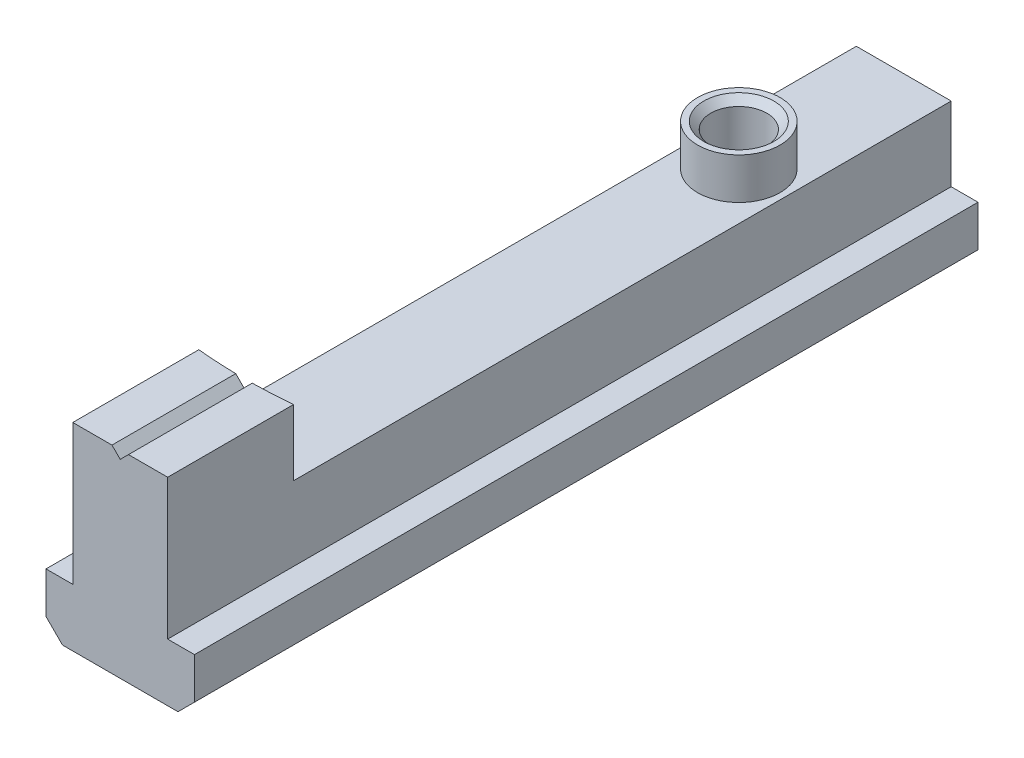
ISO-10303-21;
HEADER;
FILE_DESCRIPTION(('STEP AP214'),'2;1');
FILE_NAME('part.step','',(''),(''),'','','');
FILE_SCHEMA(('AUTOMOTIVE_DESIGN { 1 0 10303 214 1 1 1 1 }'));
ENDSEC;
DATA;
#1=APPLICATION_CONTEXT('core data for automotive mechanical design processes');
#2=APPLICATION_PROTOCOL_DEFINITION('international standard','automotive_design',2000,#1);
#3=PRODUCT_CONTEXT('',#1,'mechanical');
#4=PRODUCT('Part','Part','',(#3));
#5=PRODUCT_RELATED_PRODUCT_CATEGORY('part','',(#4));
#6=PRODUCT_DEFINITION_FORMATION('','',#4);
#7=PRODUCT_DEFINITION_CONTEXT('part definition',#1,'design');
#8=PRODUCT_DEFINITION('design','',#6,#7);
#9=PRODUCT_DEFINITION_SHAPE('','',#8);
#10=(LENGTH_UNIT() NAMED_UNIT(*) SI_UNIT(.MILLI.,.METRE.));
#11=(NAMED_UNIT(*) PLANE_ANGLE_UNIT() SI_UNIT($,.RADIAN.));
#12=(NAMED_UNIT(*) SI_UNIT($,.STERADIAN.) SOLID_ANGLE_UNIT());
#13=UNCERTAINTY_MEASURE_WITH_UNIT(LENGTH_MEASURE(1.E-05),#10,'distance_accuracy_value','');
#14=(GEOMETRIC_REPRESENTATION_CONTEXT(3) GLOBAL_UNCERTAINTY_ASSIGNED_CONTEXT((#13)) GLOBAL_UNIT_ASSIGNED_CONTEXT((#10,
#11,#12)) REPRESENTATION_CONTEXT('',''));
#15=CARTESIAN_POINT('',(0.,0.,0.));
#16=DIRECTION('',(0.,0.,1.));
#17=DIRECTION('',(1.,0.,0.));
#18=AXIS2_PLACEMENT_3D('',#15,#16,#17);
#19=CARTESIAN_POINT('',(8.99999999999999,16.,20.));
#20=DIRECTION('',(0.,1.,0.));
#21=DIRECTION('',(0.,0.,1.));
#22=AXIS2_PLACEMENT_3D('',#19,#20,#21);
#23=CYLINDRICAL_SURFACE('',#22,5.);
#24=CARTESIAN_POINT('',(8.99999999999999,16.,20.));
#25=DIRECTION('',(0.,1.,0.));
#26=DIRECTION('',(0.,0.,1.));
#27=AXIS2_PLACEMENT_3D('',#24,#25,#26);
#28=CIRCLE('',#27,5.);
#29=CARTESIAN_POINT('',(8.99999999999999,16.,25.));
#30=VERTEX_POINT('',#29);
#31=EDGE_CURVE('E257',#30,#30,#28,.T.);
#32=ORIENTED_EDGE('',*,*,#31,.T.);
#33=EDGE_LOOP('',(#32));
#34=FACE_BOUND('',#33,.T.);
#35=CARTESIAN_POINT('',(8.99999999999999,21.,20.));
#36=DIRECTION('',(0.,1.,0.));
#37=DIRECTION('',(0.,0.,1.));
#38=AXIS2_PLACEMENT_3D('',#35,#36,#37);
#39=CIRCLE('',#38,5.);
#40=CARTESIAN_POINT('',(8.99999999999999,21.,25.));
#41=VERTEX_POINT('',#40);
#42=EDGE_CURVE('E260',#41,#41,#39,.T.);
#43=ORIENTED_EDGE('',*,*,#42,.F.);
#44=EDGE_LOOP('',(#43));
#45=FACE_BOUND('',#44,.T.);
#46=ADVANCED_FACE('F30',(#34,#45),#23,.T.);
#47=CARTESIAN_POINT('',(14.75,24.,95.));
#48=DIRECTION('',(0.,-1.,0.));
#49=DIRECTION('',(0.,0.,-1.));
#50=AXIS2_PLACEMENT_3D('',#47,#48,#49);
#51=PLANE('',#50);
#52=DIRECTION('',(0.,0.,-1.));
#53=VECTOR('',#52,1.);
#54=CARTESIAN_POINT('',(14.75,24.,95.));
#55=LINE('',#54,#53);
#56=CARTESIAN_POINT('',(14.75,24.,95.));
#57=VERTEX_POINT('',#56);
#58=CARTESIAN_POINT('',(14.75,24.,79.7238436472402));
#59=VERTEX_POINT('',#58);
#60=EDGE_CURVE('E154',#57,#59,#55,.T.);
#61=ORIENTED_EDGE('',*,*,#60,.T.);
#62=CARTESIAN_POINT('',(8.99999999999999,24.,20.));
#63=DIRECTION('',(0.,1.,0.));
#64=DIRECTION('',(0.,0.,1.));
#65=AXIS2_PLACEMENT_3D('',#62,#63,#64);
#66=CIRCLE('',#65,60.);
#67=CARTESIAN_POINT('',(10.,24.,79.9916660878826));
#68=VERTEX_POINT('',#67);
#69=EDGE_CURVE('E139',#68,#59,#66,.T.);
#70=ORIENTED_EDGE('',*,*,#69,.F.);
#71=DIRECTION('',(0.,0.,1.));
#72=VECTOR('',#71,1.);
#73=CARTESIAN_POINT('',(10.,24.,75.));
#74=LINE('',#73,#72);
#75=CARTESIAN_POINT('',(10.,24.,95.));
#76=VERTEX_POINT('',#75);
#77=EDGE_CURVE('E151',#68,#76,#74,.T.);
#78=ORIENTED_EDGE('',*,*,#77,.T.);
#79=DIRECTION('',(-1.,0.,0.));
#80=VECTOR('',#79,1.);
#81=CARTESIAN_POINT('',(14.75,24.,95.));
#82=LINE('',#81,#80);
#83=EDGE_CURVE('E181',#57,#76,#82,.T.);
#84=ORIENTED_EDGE('',*,*,#83,.F.);
#85=EDGE_LOOP('',(#61,#70,#78,#84));
#86=FACE_BOUND('',#85,.T.);
#87=ADVANCED_FACE('F149',(#86),#51,.F.);
#88=CARTESIAN_POINT('',(0.,0.,0.));
#89=DIRECTION('',(0.,0.,1.));
#90=DIRECTION('',(1.,0.,0.));
#91=AXIS2_PLACEMENT_3D('',#88,#89,#90);
#92=PLANE('',#91);
#93=DIRECTION('',(-1.,0.,0.));
#94=VECTOR('',#93,1.);
#95=CARTESIAN_POINT('',(0.,16.,0.));
#96=LINE('',#95,#94);
#97=CARTESIAN_POINT('',(14.75,16.,0.));
#98=VERTEX_POINT('',#97);
#99=CARTESIAN_POINT('',(3.25,16.,0.));
#100=VERTEX_POINT('',#99);
#101=EDGE_CURVE('E11',#98,#100,#96,.T.);
#102=ORIENTED_EDGE('',*,*,#101,.F.);
#103=DIRECTION('',(0.,1.,0.));
#104=VECTOR('',#103,1.);
#105=CARTESIAN_POINT('',(14.75,7.,0.));
#106=LINE('',#105,#104);
#107=CARTESIAN_POINT('',(14.75,7.,0.));
#108=VERTEX_POINT('',#107);
#109=EDGE_CURVE('E198',#108,#98,#106,.T.);
#110=ORIENTED_EDGE('',*,*,#109,.F.);
#111=DIRECTION('',(-1.,0.,0.));
#112=VECTOR('',#111,1.);
#113=CARTESIAN_POINT('',(18.,7.,0.));
#114=LINE('',#113,#112);
#115=CARTESIAN_POINT('',(18.,7.,0.));
#116=VERTEX_POINT('',#115);
#117=EDGE_CURVE('E196',#116,#108,#114,.T.);
#118=ORIENTED_EDGE('',*,*,#117,.F.);
#119=DIRECTION('',(0.,1.,0.));
#120=VECTOR('',#119,1.);
#121=CARTESIAN_POINT('',(18.,0.,0.));
#122=LINE('',#121,#120);
#123=CARTESIAN_POINT('',(18.,2.00000000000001,0.));
#124=VERTEX_POINT('',#123);
#125=EDGE_CURVE('E194',#124,#116,#122,.T.);
#126=ORIENTED_EDGE('',*,*,#125,.F.);
#127=DIRECTION('',(0.707106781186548,0.707106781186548,0.));
#128=VECTOR('',#127,1.);
#129=CARTESIAN_POINT('',(18.,2.00000000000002,0.));
#130=LINE('',#129,#128);
#131=CARTESIAN_POINT('',(16.,0.,0.));
#132=VERTEX_POINT('',#131);
#133=EDGE_CURVE('E224',#124,#132,#130,.F.);
#134=ORIENTED_EDGE('',*,*,#133,.T.);
#135=DIRECTION('',(1.,0.,0.));
#136=VECTOR('',#135,1.);
#137=CARTESIAN_POINT('',(0.,0.,0.));
#138=LINE('',#137,#136);
#139=CARTESIAN_POINT('',(2.00000000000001,0.,0.));
#140=VERTEX_POINT('',#139);
#141=EDGE_CURVE('E191',#140,#132,#138,.T.);
#142=ORIENTED_EDGE('',*,*,#141,.F.);
#143=DIRECTION('',(0.707106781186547,-0.707106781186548,0.));
#144=VECTOR('',#143,1.);
#145=CARTESIAN_POINT('',(2.00000000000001,0.,0.));
#146=LINE('',#145,#144);
#147=CARTESIAN_POINT('',(0.,2.00000000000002,0.));
#148=VERTEX_POINT('',#147);
#149=EDGE_CURVE('E226',#140,#148,#146,.F.);
#150=ORIENTED_EDGE('',*,*,#149,.T.);
#151=DIRECTION('',(0.,-1.,0.));
#152=VECTOR('',#151,1.);
#153=CARTESIAN_POINT('',(0.,7.,0.));
#154=LINE('',#153,#152);
#155=CARTESIAN_POINT('',(0.,7.,0.));
#156=VERTEX_POINT('',#155);
#157=EDGE_CURVE('E188',#156,#148,#154,.T.);
#158=ORIENTED_EDGE('',*,*,#157,.F.);
#159=DIRECTION('',(-1.,0.,0.));
#160=VECTOR('',#159,1.);
#161=CARTESIAN_POINT('',(3.25,7.,0.));
#162=LINE('',#161,#160);
#163=CARTESIAN_POINT('',(3.25,7.,0.));
#164=VERTEX_POINT('',#163);
#165=EDGE_CURVE('E171',#164,#156,#162,.T.);
#166=ORIENTED_EDGE('',*,*,#165,.F.);
#167=DIRECTION('',(0.,-1.,0.));
#168=VECTOR('',#167,1.);
#169=CARTESIAN_POINT('',(3.25,24.,0.));
#170=LINE('',#169,#168);
#171=EDGE_CURVE('E201',#100,#164,#170,.T.);
#172=ORIENTED_EDGE('',*,*,#171,.F.);
#173=EDGE_LOOP('',(#102,#110,#118,#126,#134,#142,#150,#158,#166,#172));
#174=FACE_BOUND('',#173,.T.);
#175=ADVANCED_FACE('F309',(#174),#92,.F.);
#176=CARTESIAN_POINT('',(0.,7.,95.));
#177=DIRECTION('',(1.,0.,0.));
#178=DIRECTION('',(0.,1.,0.));
#179=AXIS2_PLACEMENT_3D('',#176,#177,#178);
#180=PLANE('',#179);
#181=ORIENTED_EDGE('',*,*,#157,.T.);
#182=DIRECTION('',(0.,0.,1.));
#183=VECTOR('',#182,1.);
#184=CARTESIAN_POINT('',(0.,2.00000000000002,95.));
#185=LINE('',#184,#183);
#186=CARTESIAN_POINT('',(0.,2.00000000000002,95.));
#187=VERTEX_POINT('',#186);
#188=EDGE_CURVE('E228',#148,#187,#185,.T.);
#189=ORIENTED_EDGE('',*,*,#188,.T.);
#190=DIRECTION('',(0.,-1.,0.));
#191=VECTOR('',#190,1.);
#192=CARTESIAN_POINT('',(0.,7.,95.));
#193=LINE('',#192,#191);
#194=CARTESIAN_POINT('',(0.,7.,95.));
#195=VERTEX_POINT('',#194);
#196=EDGE_CURVE('E167',#195,#187,#193,.T.);
#197=ORIENTED_EDGE('',*,*,#196,.F.);
#198=DIRECTION('',(0.,0.,-1.));
#199=VECTOR('',#198,1.);
#200=CARTESIAN_POINT('',(0.,7.,95.));
#201=LINE('',#200,#199);
#202=EDGE_CURVE('E187',#195,#156,#201,.T.);
#203=ORIENTED_EDGE('',*,*,#202,.T.);
#204=EDGE_LOOP('',(#181,#189,#197,#203));
#205=FACE_BOUND('',#204,.T.);
#206=ADVANCED_FACE('F328',(#205),#180,.F.);
#207=CARTESIAN_POINT('',(0.,0.,95.));
#208=DIRECTION('',(0.,1.,0.));
#209=DIRECTION('',(0.,0.,1.));
#210=AXIS2_PLACEMENT_3D('',#207,#208,#209);
#211=PLANE('',#210);
#212=CARTESIAN_POINT('',(8.99999999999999,0.,20.));
#213=DIRECTION('',(0.,1.,0.));
#214=DIRECTION('',(0.,0.,1.));
#215=AXIS2_PLACEMENT_3D('',#212,#213,#214);
#216=CIRCLE('',#215,4.24999999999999);
#217=CARTESIAN_POINT('',(8.99999999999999,0.,24.25));
#218=VERTEX_POINT('',#217);
#219=EDGE_CURVE('E272',#218,#218,#216,.T.);
#220=ORIENTED_EDGE('',*,*,#219,.T.);
#221=EDGE_LOOP('',(#220));
#222=FACE_BOUND('',#221,.T.);
#223=DIRECTION('',(1.,0.,0.));
#224=VECTOR('',#223,1.);
#225=CARTESIAN_POINT('',(0.,0.,95.));
#226=LINE('',#225,#224);
#227=CARTESIAN_POINT('',(2.00000000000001,0.,95.));
#228=VERTEX_POINT('',#227);
#229=CARTESIAN_POINT('',(16.,0.,95.));
#230=VERTEX_POINT('',#229);
#231=EDGE_CURVE('E170',#228,#230,#226,.T.);
#232=ORIENTED_EDGE('',*,*,#231,.F.);
#233=DIRECTION('',(0.,0.,-1.));
#234=VECTOR('',#233,1.);
#235=CARTESIAN_POINT('',(2.00000000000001,0.,95.));
#236=LINE('',#235,#234);
#237=EDGE_CURVE('E221',#228,#140,#236,.T.);
#238=ORIENTED_EDGE('',*,*,#237,.T.);
#239=ORIENTED_EDGE('',*,*,#141,.T.);
#240=DIRECTION('',(0.,0.,1.));
#241=VECTOR('',#240,1.);
#242=CARTESIAN_POINT('',(16.,0.,95.));
#243=LINE('',#242,#241);
#244=EDGE_CURVE('E219',#132,#230,#243,.T.);
#245=ORIENTED_EDGE('',*,*,#244,.T.);
#246=EDGE_LOOP('',(#232,#238,#239,#245));
#247=FACE_BOUND('',#246,.T.);
#248=ADVANCED_FACE('F276',(#222,#247),#211,.F.);
#249=CARTESIAN_POINT('',(18.,0.,95.));
#250=DIRECTION('',(-1.,0.,0.));
#251=DIRECTION('',(0.,0.,1.));
#252=AXIS2_PLACEMENT_3D('',#249,#250,#251);
#253=PLANE('',#252);
#254=DIRECTION('',(0.,1.,0.));
#255=VECTOR('',#254,1.);
#256=CARTESIAN_POINT('',(18.,0.,95.));
#257=LINE('',#256,#255);
#258=CARTESIAN_POINT('',(18.,2.00000000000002,95.));
#259=VERTEX_POINT('',#258);
#260=CARTESIAN_POINT('',(18.,7.,95.));
#261=VERTEX_POINT('',#260);
#262=EDGE_CURVE('E174',#259,#261,#257,.T.);
#263=ORIENTED_EDGE('',*,*,#262,.F.);
#264=DIRECTION('',(0.,0.,-1.));
#265=VECTOR('',#264,1.);
#266=CARTESIAN_POINT('',(18.,2.00000000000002,95.));
#267=LINE('',#266,#265);
#268=EDGE_CURVE('E234',#259,#124,#267,.T.);
#269=ORIENTED_EDGE('',*,*,#268,.T.);
#270=ORIENTED_EDGE('',*,*,#125,.T.);
#271=DIRECTION('',(0.,0.,-1.));
#272=VECTOR('',#271,1.);
#273=CARTESIAN_POINT('',(18.,7.,95.));
#274=LINE('',#273,#272);
#275=EDGE_CURVE('E216',#261,#116,#274,.T.);
#276=ORIENTED_EDGE('',*,*,#275,.F.);
#277=EDGE_LOOP('',(#263,#269,#270,#276));
#278=FACE_BOUND('',#277,.T.);
#279=ADVANCED_FACE('F345',(#278),#253,.F.);
#280=CARTESIAN_POINT('',(18.,7.,95.));
#281=DIRECTION('',(0.,-1.,0.));
#282=DIRECTION('',(0.,0.,-1.));
#283=AXIS2_PLACEMENT_3D('',#280,#281,#282);
#284=PLANE('',#283);
#285=ORIENTED_EDGE('',*,*,#117,.T.);
#286=DIRECTION('',(0.,0.,-1.));
#287=VECTOR('',#286,1.);
#288=CARTESIAN_POINT('',(14.75,7.,95.));
#289=LINE('',#288,#287);
#290=CARTESIAN_POINT('',(14.75,7.,95.));
#291=VERTEX_POINT('',#290);
#292=EDGE_CURVE('E213',#291,#108,#289,.T.);
#293=ORIENTED_EDGE('',*,*,#292,.F.);
#294=DIRECTION('',(-1.,0.,0.));
#295=VECTOR('',#294,1.);
#296=CARTESIAN_POINT('',(18.,7.,95.));
#297=LINE('',#296,#295);
#298=EDGE_CURVE('E176',#261,#291,#297,.T.);
#299=ORIENTED_EDGE('',*,*,#298,.F.);
#300=ORIENTED_EDGE('',*,*,#275,.T.);
#301=EDGE_LOOP('',(#285,#293,#299,#300));
#302=FACE_BOUND('',#301,.T.);
#303=ADVANCED_FACE('F341',(#302),#284,.F.);
#304=CARTESIAN_POINT('',(14.75,7.,95.));
#305=DIRECTION('',(-1.,0.,0.));
#306=DIRECTION('',(0.,0.,1.));
#307=AXIS2_PLACEMENT_3D('',#304,#305,#306);
#308=PLANE('',#307);
#309=DIRECTION('',(0.,0.,-1.));
#310=VECTOR('',#309,1.);
#311=CARTESIAN_POINT('',(14.75,16.,95.));
#312=LINE('',#311,#310);
#313=CARTESIAN_POINT('',(14.75,16.,79.7238436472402));
#314=VERTEX_POINT('',#313);
#315=EDGE_CURVE('E245',#314,#98,#312,.T.);
#316=ORIENTED_EDGE('',*,*,#315,.F.);
#317=DIRECTION('',(0.,1.,0.));
#318=VECTOR('',#317,1.);
#319=CARTESIAN_POINT('',(14.75,16.,79.7238436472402));
#320=LINE('',#319,#318);
#321=EDGE_CURVE('E251',#314,#59,#320,.T.);
#322=ORIENTED_EDGE('',*,*,#321,.T.);
#323=ORIENTED_EDGE('',*,*,#60,.F.);
#324=DIRECTION('',(0.,1.,0.));
#325=VECTOR('',#324,1.);
#326=CARTESIAN_POINT('',(14.75,7.,95.));
#327=LINE('',#326,#325);
#328=EDGE_CURVE('E178',#291,#57,#327,.T.);
#329=ORIENTED_EDGE('',*,*,#328,.F.);
#330=ORIENTED_EDGE('',*,*,#292,.T.);
#331=ORIENTED_EDGE('',*,*,#109,.T.);
#332=EDGE_LOOP('',(#316,#322,#323,#329,#330,#331));
#333=FACE_BOUND('',#332,.T.);
#334=ADVANCED_FACE('F338',(#333),#308,.F.);
#335=DIRECTION('',(0.,0.,1.));
#336=VECTOR('',#335,1.);
#337=CARTESIAN_POINT('',(8.,24.,75.));
#338=LINE('',#337,#336);
#339=CARTESIAN_POINT('',(8.,24.,79.9916660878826));
#340=VERTEX_POINT('',#339);
#341=CARTESIAN_POINT('',(8.,24.,95.));
#342=VERTEX_POINT('',#341);
#343=EDGE_CURVE('E52',#340,#342,#338,.T.);
#344=ORIENTED_EDGE('',*,*,#343,.F.);
#345=CARTESIAN_POINT('',(3.25,24.,79.7238436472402));
#346=VERTEX_POINT('',#345);
#347=EDGE_CURVE('E45',#346,#340,#66,.T.);
#348=ORIENTED_EDGE('',*,*,#347,.F.);
#349=DIRECTION('',(0.,0.,-1.));
#350=VECTOR('',#349,1.);
#351=CARTESIAN_POINT('',(3.25,24.,95.));
#352=LINE('',#351,#350);
#353=CARTESIAN_POINT('',(3.25,24.,95.));
#354=VERTEX_POINT('',#353);
#355=EDGE_CURVE('E209',#354,#346,#352,.T.);
#356=ORIENTED_EDGE('',*,*,#355,.F.);
#357=EDGE_CURVE('E180',#342,#354,#82,.T.);
#358=ORIENTED_EDGE('',*,*,#357,.F.);
#359=EDGE_LOOP('',(#344,#348,#356,#358));
#360=FACE_BOUND('',#359,.T.);
#361=ADVANCED_FACE('F239',(#360),#51,.F.);
#362=CARTESIAN_POINT('',(3.25,24.,95.));
#363=DIRECTION('',(1.,0.,0.));
#364=DIRECTION('',(0.,1.,0.));
#365=AXIS2_PLACEMENT_3D('',#362,#363,#364);
#366=PLANE('',#365);
#367=ORIENTED_EDGE('',*,*,#355,.T.);
#368=DIRECTION('',(0.,1.,0.));
#369=VECTOR('',#368,1.);
#370=CARTESIAN_POINT('',(3.25,16.,79.7238436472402));
#371=LINE('',#370,#369);
#372=CARTESIAN_POINT('',(3.25,16.,79.7238436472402));
#373=VERTEX_POINT('',#372);
#374=EDGE_CURVE('E144',#346,#373,#371,.F.);
#375=ORIENTED_EDGE('',*,*,#374,.T.);
#376=DIRECTION('',(0.,0.,1.));
#377=VECTOR('',#376,1.);
#378=CARTESIAN_POINT('',(3.25,16.,95.));
#379=LINE('',#378,#377);
#380=EDGE_CURVE('E247',#100,#373,#379,.T.);
#381=ORIENTED_EDGE('',*,*,#380,.F.);
#382=ORIENTED_EDGE('',*,*,#171,.T.);
#383=DIRECTION('',(0.,0.,-1.));
#384=VECTOR('',#383,1.);
#385=CARTESIAN_POINT('',(3.25,7.,95.));
#386=LINE('',#385,#384);
#387=CARTESIAN_POINT('',(3.25,7.,95.));
#388=VERTEX_POINT('',#387);
#389=EDGE_CURVE('E206',#388,#164,#386,.T.);
#390=ORIENTED_EDGE('',*,*,#389,.F.);
#391=DIRECTION('',(0.,-1.,0.));
#392=VECTOR('',#391,1.);
#393=CARTESIAN_POINT('',(3.25,24.,95.));
#394=LINE('',#393,#392);
#395=EDGE_CURVE('E183',#354,#388,#394,.T.);
#396=ORIENTED_EDGE('',*,*,#395,.F.);
#397=EDGE_LOOP('',(#367,#375,#381,#382,#390,#396));
#398=FACE_BOUND('',#397,.T.);
#399=ADVANCED_FACE('F332',(#398),#366,.F.);
#400=CARTESIAN_POINT('',(3.25,7.,95.));
#401=DIRECTION('',(0.,-1.,0.));
#402=DIRECTION('',(0.,0.,-1.));
#403=AXIS2_PLACEMENT_3D('',#400,#401,#402);
#404=PLANE('',#403);
#405=ORIENTED_EDGE('',*,*,#165,.T.);
#406=ORIENTED_EDGE('',*,*,#202,.F.);
#407=DIRECTION('',(-1.,0.,0.));
#408=VECTOR('',#407,1.);
#409=CARTESIAN_POINT('',(3.25,7.,95.));
#410=LINE('',#409,#408);
#411=EDGE_CURVE('E185',#388,#195,#410,.T.);
#412=ORIENTED_EDGE('',*,*,#411,.F.);
#413=ORIENTED_EDGE('',*,*,#389,.T.);
#414=EDGE_LOOP('',(#405,#406,#412,#413));
#415=FACE_BOUND('',#414,.T.);
#416=ADVANCED_FACE('F325',(#415),#404,.F.);
#417=CARTESIAN_POINT('',(0.,0.,95.));
#418=DIRECTION('',(0.,0.,1.));
#419=DIRECTION('',(1.,0.,0.));
#420=AXIS2_PLACEMENT_3D('',#417,#418,#419);
#421=PLANE('',#420);
#422=DIRECTION('',(0.707106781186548,0.707106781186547,0.));
#423=VECTOR('',#422,1.);
#424=CARTESIAN_POINT('',(9.,23.,95.));
#425=LINE('',#424,#423);
#426=CARTESIAN_POINT('',(9.,23.,95.));
#427=VERTEX_POINT('',#426);
#428=EDGE_CURVE('E158',#427,#76,#425,.T.);
#429=ORIENTED_EDGE('',*,*,#428,.F.);
#430=DIRECTION('',(0.707106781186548,-0.707106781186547,0.));
#431=VECTOR('',#430,1.);
#432=CARTESIAN_POINT('',(9.,23.,95.));
#433=LINE('',#432,#431);
#434=EDGE_CURVE('E160',#342,#427,#433,.T.);
#435=ORIENTED_EDGE('',*,*,#434,.F.);
#436=ORIENTED_EDGE('',*,*,#357,.T.);
#437=ORIENTED_EDGE('',*,*,#395,.T.);
#438=ORIENTED_EDGE('',*,*,#411,.T.);
#439=ORIENTED_EDGE('',*,*,#196,.T.);
#440=DIRECTION('',(-0.707106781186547,0.707106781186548,0.));
#441=VECTOR('',#440,1.);
#442=CARTESIAN_POINT('',(1.00000000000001,1.00000000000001,95.));
#443=LINE('',#442,#441);
#444=EDGE_CURVE('E232',#187,#228,#443,.F.);
#445=ORIENTED_EDGE('',*,*,#444,.T.);
#446=ORIENTED_EDGE('',*,*,#231,.T.);
#447=DIRECTION('',(-0.707106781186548,-0.707106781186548,0.));
#448=VECTOR('',#447,1.);
#449=CARTESIAN_POINT('',(7.99999999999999,-7.99999999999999,95.));
#450=LINE('',#449,#448);
#451=EDGE_CURVE('E230',#230,#259,#450,.F.);
#452=ORIENTED_EDGE('',*,*,#451,.T.);
#453=ORIENTED_EDGE('',*,*,#262,.T.);
#454=ORIENTED_EDGE('',*,*,#298,.T.);
#455=ORIENTED_EDGE('',*,*,#328,.T.);
#456=ORIENTED_EDGE('',*,*,#83,.T.);
#457=EDGE_LOOP('',(#429,#435,#436,#437,#438,#439,#445,#446,#452,#453,#454,#455,#456));
#458=FACE_BOUND('',#457,.T.);
#459=ADVANCED_FACE('F243',(#458),#421,.T.);
#460=CARTESIAN_POINT('',(2.00000000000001,0.,95.));
#461=DIRECTION('',(0.707106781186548,0.707106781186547,0.));
#462=DIRECTION('',(-0.707106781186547,0.707106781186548,0.));
#463=AXIS2_PLACEMENT_3D('',#460,#461,#462);
#464=PLANE('',#463);
#465=ORIENTED_EDGE('',*,*,#444,.F.);
#466=ORIENTED_EDGE('',*,*,#188,.F.);
#467=ORIENTED_EDGE('',*,*,#149,.F.);
#468=ORIENTED_EDGE('',*,*,#237,.F.);
#469=EDGE_LOOP('',(#465,#466,#467,#468));
#470=FACE_BOUND('',#469,.T.);
#471=ADVANCED_FACE('F324',(#470),#464,.F.);
#472=CARTESIAN_POINT('',(18.,2.00000000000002,95.));
#473=DIRECTION('',(-0.707106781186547,0.707106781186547,0.));
#474=DIRECTION('',(-0.707106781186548,-0.707106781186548,0.));
#475=AXIS2_PLACEMENT_3D('',#472,#473,#474);
#476=PLANE('',#475);
#477=ORIENTED_EDGE('',*,*,#451,.F.);
#478=ORIENTED_EDGE('',*,*,#244,.F.);
#479=ORIENTED_EDGE('',*,*,#133,.F.);
#480=ORIENTED_EDGE('',*,*,#268,.F.);
#481=EDGE_LOOP('',(#477,#478,#479,#480));
#482=FACE_BOUND('',#481,.T.);
#483=ADVANCED_FACE('F32',(#482),#476,.F.);
#484=CARTESIAN_POINT('',(9.,23.,75.));
#485=DIRECTION('',(0.707106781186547,-0.707106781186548,0.));
#486=DIRECTION('',(0.707106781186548,0.707106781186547,0.));
#487=AXIS2_PLACEMENT_3D('',#484,#485,#486);
#488=PLANE('',#487);
#489=ORIENTED_EDGE('',*,*,#77,.F.);
#490=CARTESIAN_POINT('',(8.99999999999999,23.,20.));
#491=DIRECTION('',(0.707106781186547,-0.707106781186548,0.));
#492=DIRECTION('',(0.707106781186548,0.707106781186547,0.));
#493=AXIS2_PLACEMENT_3D('',#490,#491,#492);
#494=ELLIPSE('',#493,84.8528137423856,60.);
#495=CARTESIAN_POINT('',(9.,23.,80.));
#496=VERTEX_POINT('',#495);
#497=EDGE_CURVE('E135',#68,#496,#494,.T.);
#498=ORIENTED_EDGE('',*,*,#497,.T.);
#499=DIRECTION('',(0.,0.,1.));
#500=VECTOR('',#499,1.);
#501=CARTESIAN_POINT('',(9.,23.,75.));
#502=LINE('',#501,#500);
#503=EDGE_CURVE('E162',#496,#427,#502,.T.);
#504=ORIENTED_EDGE('',*,*,#503,.T.);
#505=ORIENTED_EDGE('',*,*,#428,.T.);
#506=EDGE_LOOP('',(#489,#498,#504,#505));
#507=FACE_BOUND('',#506,.T.);
#508=ADVANCED_FACE('F156',(#507),#488,.F.);
#509=CARTESIAN_POINT('',(9.,23.,75.));
#510=DIRECTION('',(-0.707106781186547,-0.707106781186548,0.));
#511=DIRECTION('',(0.707106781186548,-0.707106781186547,0.));
#512=AXIS2_PLACEMENT_3D('',#509,#510,#511);
#513=PLANE('',#512);
#514=ORIENTED_EDGE('',*,*,#503,.F.);
#515=CARTESIAN_POINT('',(8.99999999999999,23.,20.));
#516=DIRECTION('',(-0.707106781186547,-0.707106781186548,0.));
#517=DIRECTION('',(-0.707106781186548,0.707106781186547,0.));
#518=AXIS2_PLACEMENT_3D('',#515,#516,#517);
#519=ELLIPSE('',#518,84.8528137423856,60.);
#520=EDGE_CURVE('E38',#496,#340,#519,.T.);
#521=ORIENTED_EDGE('',*,*,#520,.T.);
#522=ORIENTED_EDGE('',*,*,#343,.T.);
#523=ORIENTED_EDGE('',*,*,#434,.T.);
#524=EDGE_LOOP('',(#514,#521,#522,#523));
#525=FACE_BOUND('',#524,.T.);
#526=ADVANCED_FACE('F236',(#525),#513,.F.);
#527=CARTESIAN_POINT('',(8.99999999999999,16.,20.));
#528=DIRECTION('',(0.,1.,0.));
#529=DIRECTION('',(0.,0.,1.));
#530=AXIS2_PLACEMENT_3D('',#527,#528,#529);
#531=PLANE('',#530);
#532=ORIENTED_EDGE('',*,*,#31,.F.);
#533=EDGE_LOOP('',(#532));
#534=FACE_BOUND('',#533,.T.);
#535=ORIENTED_EDGE('',*,*,#315,.T.);
#536=ORIENTED_EDGE('',*,*,#101,.T.);
#537=ORIENTED_EDGE('',*,*,#380,.T.);
#538=CARTESIAN_POINT('',(8.99999999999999,16.,20.));
#539=DIRECTION('',(0.,1.,0.));
#540=DIRECTION('',(0.,0.,1.));
#541=AXIS2_PLACEMENT_3D('',#538,#539,#540);
#542=CIRCLE('',#541,60.);
#543=EDGE_CURVE('E145',#373,#314,#542,.T.);
#544=ORIENTED_EDGE('',*,*,#543,.T.);
#545=EDGE_LOOP('',(#535,#536,#537,#544));
#546=FACE_BOUND('',#545,.T.);
#547=ADVANCED_FACE('F312',(#534,#546),#531,.T.);
#548=CARTESIAN_POINT('',(8.99999999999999,16.,20.));
#549=DIRECTION('',(0.,1.,0.));
#550=DIRECTION('',(0.,0.,1.));
#551=AXIS2_PLACEMENT_3D('',#548,#549,#550);
#552=CYLINDRICAL_SURFACE('',#551,60.);
#553=ORIENTED_EDGE('',*,*,#543,.F.);
#554=ORIENTED_EDGE('',*,*,#374,.F.);
#555=ORIENTED_EDGE('',*,*,#347,.T.);
#556=ORIENTED_EDGE('',*,*,#520,.F.);
#557=ORIENTED_EDGE('',*,*,#497,.F.);
#558=ORIENTED_EDGE('',*,*,#69,.T.);
#559=ORIENTED_EDGE('',*,*,#321,.F.);
#560=EDGE_LOOP('',(#553,#554,#555,#556,#557,#558,#559));
#561=FACE_BOUND('',#560,.T.);
#562=ADVANCED_FACE('F138',(#561),#552,.F.);
#563=CARTESIAN_POINT('',(8.99999999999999,21.,20.));
#564=DIRECTION('',(0.,1.,0.));
#565=DIRECTION('',(0.,0.,1.));
#566=AXIS2_PLACEMENT_3D('',#563,#564,#565);
#567=PLANE('',#566);
#568=CARTESIAN_POINT('',(8.99999999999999,21.,20.));
#569=DIRECTION('',(0.,1.,0.));
#570=DIRECTION('',(0.,0.,1.));
#571=AXIS2_PLACEMENT_3D('',#568,#569,#570);
#572=CIRCLE('',#571,4.25);
#573=CARTESIAN_POINT('',(8.99999999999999,21.,24.25));
#574=VERTEX_POINT('',#573);
#575=EDGE_CURVE('E269',#574,#574,#572,.T.);
#576=ORIENTED_EDGE('',*,*,#575,.F.);
#577=EDGE_LOOP('',(#576));
#578=FACE_BOUND('',#577,.T.);
#579=ORIENTED_EDGE('',*,*,#42,.T.);
#580=EDGE_LOOP('',(#579));
#581=FACE_BOUND('',#580,.T.);
#582=ADVANCED_FACE('F283',(#578,#581),#567,.T.);
#583=CARTESIAN_POINT('',(8.99999999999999,0.849999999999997,20.));
#584=DIRECTION('',(0.,-1.,0.));
#585=DIRECTION('',(0.,0.,-1.));
#586=AXIS2_PLACEMENT_3D('',#583,#584,#585);
#587=CONICAL_SURFACE('',#586,3.4,0.78539816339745);
#588=ORIENTED_EDGE('',*,*,#219,.F.);
#589=EDGE_LOOP('',(#588));
#590=FACE_BOUND('',#589,.T.);
#591=CARTESIAN_POINT('',(8.99999999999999,0.849999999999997,20.));
#592=DIRECTION('',(0.,1.,0.));
#593=DIRECTION('',(0.,0.,1.));
#594=AXIS2_PLACEMENT_3D('',#591,#592,#593);
#595=CIRCLE('',#594,3.4);
#596=CARTESIAN_POINT('',(8.99999999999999,0.849999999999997,23.4));
#597=VERTEX_POINT('',#596);
#598=EDGE_CURVE('E263',#597,#597,#595,.T.);
#599=ORIENTED_EDGE('',*,*,#598,.T.);
#600=EDGE_LOOP('',(#599));
#601=FACE_BOUND('',#600,.T.);
#602=ADVANCED_FACE('F279',(#590,#601),#587,.F.);
#603=CARTESIAN_POINT('',(8.99999999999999,21.,20.));
#604=DIRECTION('',(0.,1.,0.));
#605=DIRECTION('',(0.,0.,1.));
#606=AXIS2_PLACEMENT_3D('',#603,#604,#605);
#607=CYLINDRICAL_SURFACE('',#606,3.39999999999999);
#608=ORIENTED_EDGE('',*,*,#598,.F.);
#609=EDGE_LOOP('',(#608));
#610=FACE_BOUND('',#609,.T.);
#611=CARTESIAN_POINT('',(8.99999999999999,20.15,20.));
#612=DIRECTION('',(0.,1.,0.));
#613=DIRECTION('',(0.,0.,1.));
#614=AXIS2_PLACEMENT_3D('',#611,#612,#613);
#615=CIRCLE('',#614,3.39999999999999);
#616=CARTESIAN_POINT('',(8.99999999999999,20.15,23.4));
#617=VERTEX_POINT('',#616);
#618=EDGE_CURVE('E266',#617,#617,#615,.T.);
#619=ORIENTED_EDGE('',*,*,#618,.T.);
#620=EDGE_LOOP('',(#619));
#621=FACE_BOUND('',#620,.T.);
#622=ADVANCED_FACE('F282',(#610,#621),#607,.F.);
#623=CARTESIAN_POINT('',(8.99999999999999,21.,20.));
#624=DIRECTION('',(0.,1.,0.));
#625=DIRECTION('',(0.,0.,1.));
#626=AXIS2_PLACEMENT_3D('',#623,#624,#625);
#627=CONICAL_SURFACE('',#626,4.25,0.785398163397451);
#628=ORIENTED_EDGE('',*,*,#618,.F.);
#629=EDGE_LOOP('',(#628));
#630=FACE_BOUND('',#629,.T.);
#631=ORIENTED_EDGE('',*,*,#575,.T.);
#632=EDGE_LOOP('',(#631));
#633=FACE_BOUND('',#632,.T.);
#634=ADVANCED_FACE('F289',(#630,#633),#627,.F.);
#635=CLOSED_SHELL('',(#46,#87,#175,#206,#248,#279,#303,#334,#361,#399,#416,#459,#471,#483,#508,
#526,#547,#562,#582,#602,#622,#634));
#636=MANIFOLD_SOLID_BREP('B2',#635);
#637=ADVANCED_BREP_SHAPE_REPRESENTATION('',(#18,#636),#14);
#638=SHAPE_DEFINITION_REPRESENTATION(#9,#637);
ENDSEC;
END-ISO-10303-21;
